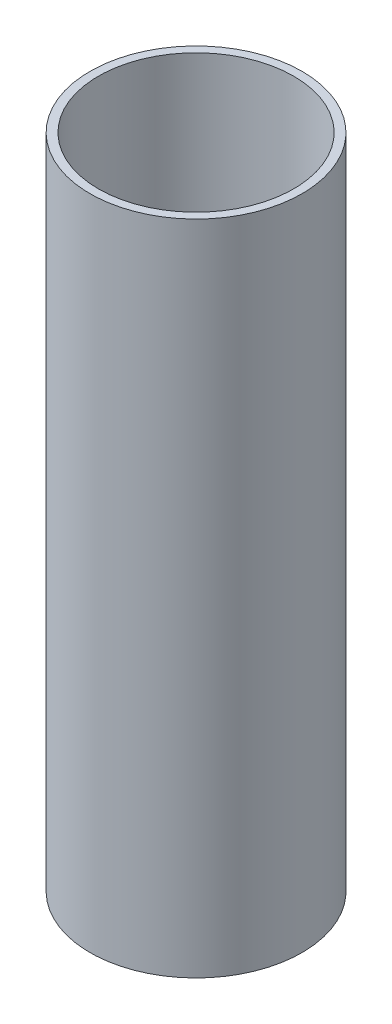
from build123d import *

# Parameters (mm, degrees)
SKETCH1_R           = 37.846
SKETCH1_R_2         = 34.8615
BOSS_EXTRUDE1_DEPTH = 234.608624


with BuildPart() as part:
    # Sketch1 → Boss-Extrude1 (new body)
    with BuildSketch(Plane(origin=(0, 0, 0), x_dir=(1, 0, 0), z_dir=(0, 1, 0))):
        with Locations(Location((0, 0, 0), (0, 0, 90))):
            Circle(SKETCH1_R)
        with Locations(Location((0, 0, 0), (0, 0, 90))):
            Circle(SKETCH1_R_2, mode=Mode.SUBTRACT)
    extrude(amount=BOSS_EXTRUDE1_DEPTH)


solid = part.part
